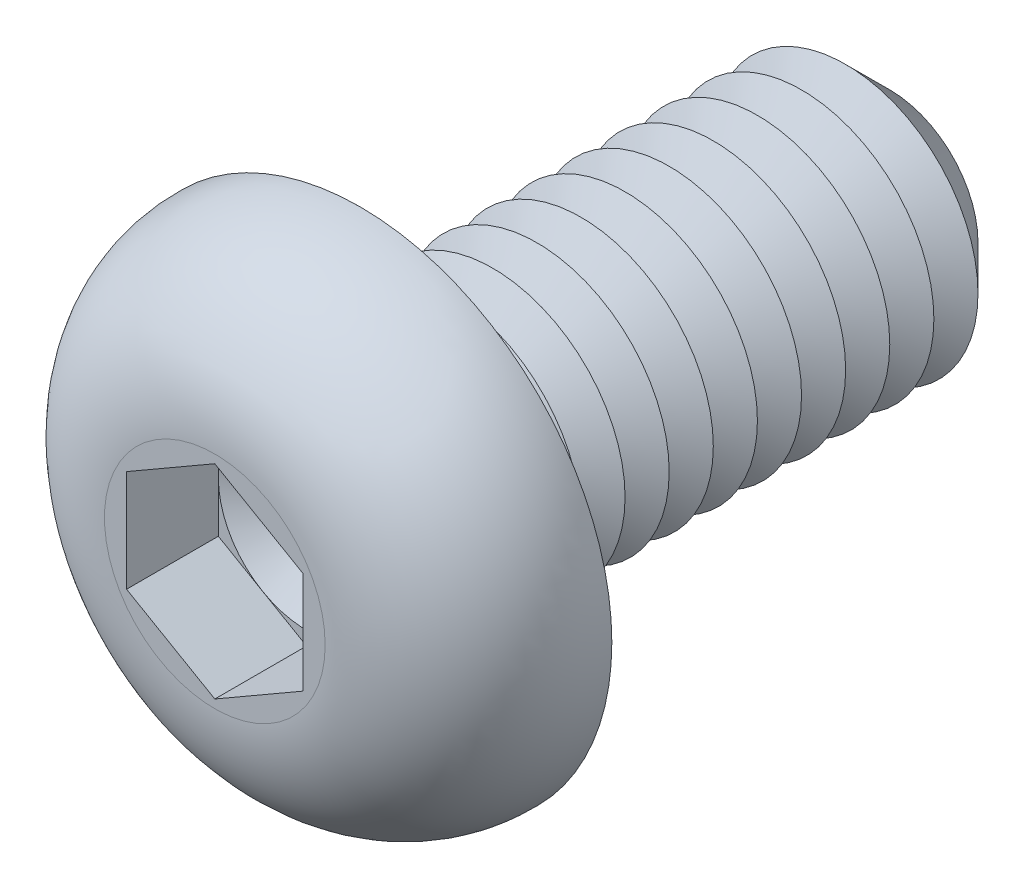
from build123d import *

# Parameters (mm, degrees)
CUT_EXTRUDE1_DEPTH  = 1.04
SKETCH4_R           = 1.5
BOSS_EXTRUDE1_DEPTH = 6
CHAMFER1_SIZE       = 0.5
LPATTERN1_COUNT     = 10
LPATTERN1_PITCH     = 0.5
FILLET2_R           = 0.2


with BuildPart() as part:
    # Sketch2 → Revolve1 (revolve)
    with BuildSketch(Plane(origin=(0, 0, 0), x_dir=(0, 0, -1), z_dir=(1, 0, 0)), mode=Mode.PRIVATE) as revolve1_sk:
        with BuildLine():
            Line((0, 0), (-1.65, 0))
            Line((-1.65, 0), (-1.65, 1.250781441))
            ThreePointArc((-1.65, 1.250781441), (-1.163552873, 2.39969397), (0, 2.85))
            Line((0, 2.85), (0, 0))
        make_face()
    revolve(revolve1_sk.sketch.rotate(Axis((0, 0, 47.934239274), (0, 0, -1)), 90), axis=Axis((0, 0, 47.934239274), (0, 0, -1)))

    # Sketch3 → Cut-Extrude1 (cut)
    with BuildSketch(Plane.XY.offset(1.65)):
        Polygon((0, 1.154700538), (-1, 0.577350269), (-1, -0.577350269), (0, -1.154700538), (1, -0.577350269), (1, 0.577350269), align=None)
    extrude(amount=-CUT_EXTRUDE1_DEPTH, mode=Mode.SUBTRACT)

    # Sketch4 → Boss-Extrude1 (add)
    with BuildSketch(Plane(origin=(0, 0, 0), x_dir=(-1, 0, 0), z_dir=(0, 0, -1))):
        with Locations(Location((0, 0, 0), (0, 0, 180))):
            Circle(SKETCH4_R)
    extrude(amount=BOSS_EXTRUDE1_DEPTH)

    # Chamfer1
    chamfer1_edges = [part.edges().sort_by_distance(p)[0] for p in [
        (-1.5, 0, -6),
    ]]
    chamfer(chamfer1_edges, length=CHAMFER1_SIZE)

    # Sketch5 → Cut-Revolve1 (revolve, cut)
    with BuildSketch(Plane(origin=(0, 0, 0), x_dir=(0, 0, -1), z_dir=(1, 0, 0)), mode=Mode.PRIVATE) as cut_revolve1_sk:
        Polygon((0.5, 1.5), (1, 1.5), (0.75, 1.066987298), align=None)
    cut_revolve1 = revolve(cut_revolve1_sk.sketch.rotate(Axis((0, 0, 47.934239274), (0, 0, -1)), 90), axis=Axis((0, 0, 47.934239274), (0, 0, -1)), mode=Mode.SUBTRACT)

    # LPattern1: Cut-Revolve1 ×10
    with Locations(*[(0, 0, -i * LPATTERN1_PITCH) for i in range(1, LPATTERN1_COUNT)]):
        add(cut_revolve1, mode=Mode.SUBTRACT)

    # Fillet2
    fillet2_edges = [part.edges().sort_by_distance(p)[0] for p in [
        (-1.5, 0, 0),
    ]]
    fillet(fillet2_edges, radius=FILLET2_R)

    # Cut-Extrude2 cone 1 section (on through the dimple's axis) → Cut-Extrude2 (revolve, cut)
    with BuildSketch(Plane(origin=(0, 0, 0.61), x_dir=(0, -1, 0), z_dir=(1, 0, 0))):
        Polygon((0, 0), (1, 0), (0, 0.577350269), align=None)
    revolve(axis=Axis((0, 0, 0.61), (0, 0, -1)), mode=Mode.SUBTRACT)


solid = part.part
